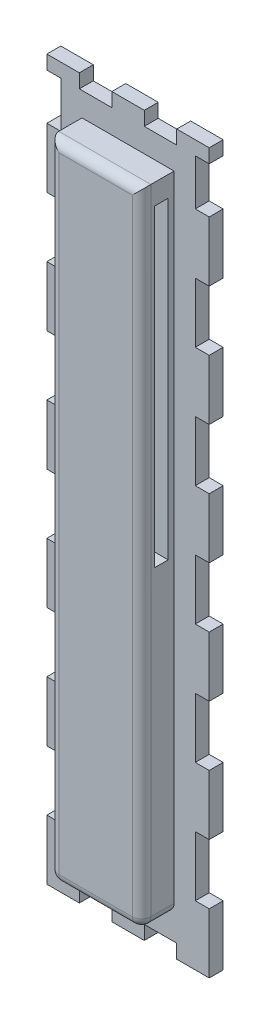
from build123d import *

# Parameters (mm, degrees)
BOSS_EXTRUDE1_DEPTH     = 3
CUT_EXTRUDE4_DEPTH      = 18
CUT_EXTRUDE4_DEPTH_BACK = 41
SKETCH3_W               = 3
SKETCH3_H               = 9.916666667
SKETCH3_H_2             = 12.916666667
SKETCH3_H_3             = 12.916666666
SKETCH4_W               = 13.387887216
SKETCH4_H               = 132.632105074
CUT_EXTRUDE5_DEPTH      = 10
SKETCH5_W               = 19.848734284
SKETCH5_H               = 138.73438234
BOSS_EXTRUDE2_DEPTH     = 7
SKETCH8_W               = 3
SKETCH8_H               = 67.516136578
CUT_EXTRUDE6_DEPTH      = 5
SKETCH9_W               = 13.387887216
SKETCH9_H               = 132.632105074
CUT_EXTRUDE7_DEPTH      = 5
FILLET1_R               = 2
SKETCH10_R              = 1
BOSS_EXTRUDE3_DEPTH     = 14


with BuildPart() as part:
    # Sketch1 → Boss-Extrude1 (new body)
    with BuildSketch(Plane.XY):
        Polygon((3.5, 74.5), (10.5, 74.5), (10.5, 77.5), (17.5, 77.5), (17.5, -77.5), (10.5, -77.5), (10.5, -74.5), (3.5, -74.5), (3.5, -77.5), (-3.5, -77.5), (-3.5, -74.5), (-10.5, -74.5), (-10.5, -77.5), (-17.5, -77.5), (-17.5, 77.5), (-10.5, 77.5), (-10.5, 74.5), (-3.5, 74.5), (-3.5, 77.5), (3.5, 77.5), align=None)
    extrude(amount=BOSS_EXTRUDE1_DEPTH)

    # Sketch3 → Cut-Extrude4 (cut, two sides: drawn at the far end of the back side and taken through both)
    with BuildSketch(Plane.XY.offset(-CUT_EXTRUDE4_DEPTH_BACK)):
        with Locations((-16, 69.541666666)):
            Rectangle(SKETCH3_W, SKETCH3_H)
        with Locations((-16, 45.208333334)):
            Rectangle(SKETCH3_W, SKETCH3_H_2)
        with Locations((-16, 19.375)):
            Rectangle(SKETCH3_W, SKETCH3_H_3)
        with Locations((-16, -6.458333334)):
            Rectangle(SKETCH3_W, SKETCH3_H_2)
        with Locations((-16, -32.291666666)):
            Rectangle(SKETCH3_W, SKETCH3_H_2)
        with Locations((-16, -58.125)):
            Rectangle(SKETCH3_W, SKETCH3_H_3)
        with Locations((16, -58.125)):
            Rectangle(SKETCH3_W, SKETCH3_H_3)
        with Locations((16, -32.291666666)):
            Rectangle(SKETCH3_W, SKETCH3_H_2)
        with Locations((16, -6.458333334)):
            Rectangle(SKETCH3_W, SKETCH3_H_2)
        with Locations((16, 19.375)):
            Rectangle(SKETCH3_W, SKETCH3_H_3)
        with Locations((16, 45.208333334)):
            Rectangle(SKETCH3_W, SKETCH3_H_2)
        with Locations((16, 69.541666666)):
            Rectangle(SKETCH3_W, SKETCH3_H)
    extrude(amount=CUT_EXTRUDE4_DEPTH + CUT_EXTRUDE4_DEPTH_BACK, mode=Mode.SUBTRACT)

    # Sketch4 → Cut-Extrude5 (cut)
    with BuildSketch(Plane.XY.offset(3)):
        Rectangle(SKETCH4_W, SKETCH4_H)
    extrude(amount=-CUT_EXTRUDE5_DEPTH, mode=Mode.SUBTRACT)

    # Sketch5 → Boss-Extrude2 (add)
    with BuildSketch(Plane.XY.offset(3)):
        Rectangle(SKETCH5_W, SKETCH5_H)
    extrude(amount=BOSS_EXTRUDE2_DEPTH)

    # Sketch8 → Cut-Extrude6 (cut)
    with BuildSketch(Plane(origin=(9.924367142, 0, 0), x_dir=(0, 0, -1), z_dir=(1, 0, 0))):
        with Locations((-5.767660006, 31.172571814)):
            Rectangle(SKETCH8_W, SKETCH8_H)
    extrude(amount=-CUT_EXTRUDE6_DEPTH, mode=Mode.SUBTRACT)

    # Sketch9 → Cut-Extrude7 (cut)
    with BuildSketch(Plane(origin=(0, 0, 3), x_dir=(-1, 0, 0), z_dir=(0, 0, -1))):
        Rectangle(SKETCH9_W, SKETCH9_H)
    extrude(amount=-CUT_EXTRUDE7_DEPTH, mode=Mode.SUBTRACT)

    # Fillet1
    fillet1_edges = [part.edges().sort_by_distance(p)[0] for p in [
        (9.924367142, -69.36719117, 6.5),
        (-9.924367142, -69.36719117, 6.5),
        (9.924367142, 0, 10),
        (0, 69.36719117, 10),
        (-9.924367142, 0, 10),
        (0, -69.36719117, 10),
    ]]
    fillet(fillet1_edges, radius=FILLET1_R)

    # Sketch10 → Boss-Extrude3 (add)
    with BuildSketch(Plane.ZY.offset(-6.693943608)):
        with Locations(Location((1.656613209, -64.120345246, 0), (0, 0, 180))):
            Circle(SKETCH10_R)
        with Locations(Location((1.656613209, -49.120345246, 0), (0, 0, 180))):
            Circle(SKETCH10_R)
        with Locations(Location((1.656613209, -34.120345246, 0), (0, 0, 180))):
            Circle(SKETCH10_R)
        with Locations(Location((1.656613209, -19.120345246, 0), (0, 0, 180))):
            Circle(SKETCH10_R)
        with Locations(Location((1.656613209, -4.120345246, 0), (0, 0, 180))):
            Circle(SKETCH10_R)
        with Locations(Location((1.656613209, 10.879654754, 0), (0, 0, 180))):
            Circle(SKETCH10_R)
        with Locations(Location((1.656613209, 25.879654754, 0), (0, 0, 180))):
            Circle(SKETCH10_R)
        with Locations(Location((1.656613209, 40.879654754, 0), (0, 0, 180))):
            Circle(SKETCH10_R)
        with Locations(Location((1.656613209, 55.879654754, 0), (0, 0, 180))):
            Circle(SKETCH10_R)
    extrude(amount=BOSS_EXTRUDE3_DEPTH)


solid = part.part
